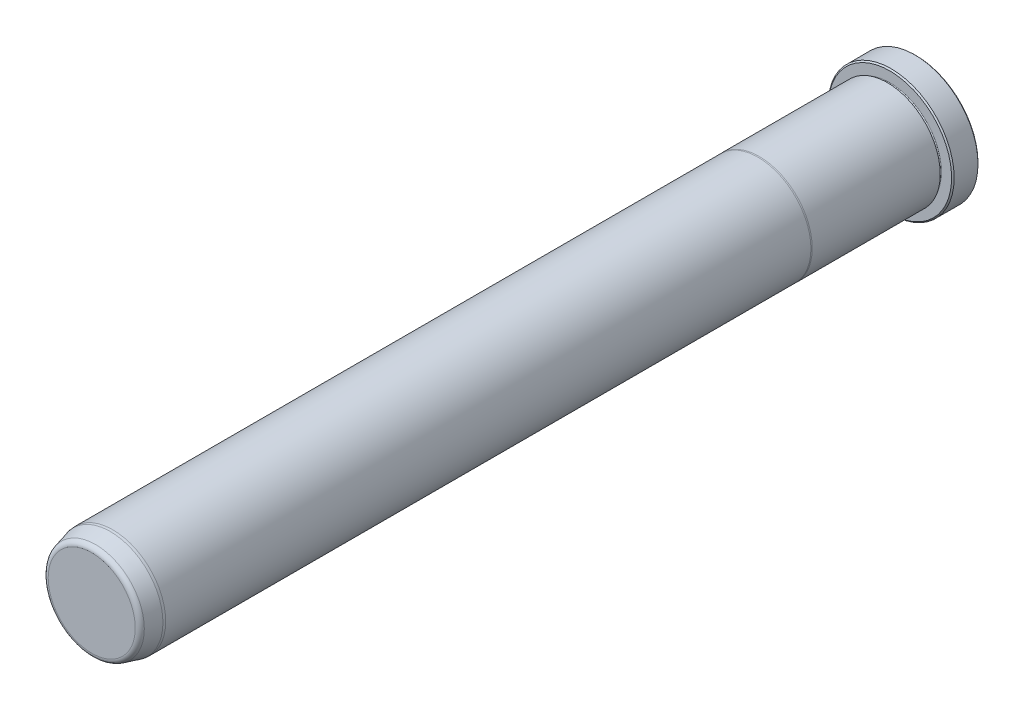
ISO-10303-21;
HEADER;
FILE_DESCRIPTION(('STEP AP214'),'2;1');
FILE_NAME('part.step','',(''),(''),'','','');
FILE_SCHEMA(('AUTOMOTIVE_DESIGN { 1 0 10303 214 1 1 1 1 }'));
ENDSEC;
DATA;
#1=APPLICATION_CONTEXT('core data for automotive mechanical design processes');
#2=APPLICATION_PROTOCOL_DEFINITION('international standard','automotive_design',2000,#1);
#3=PRODUCT_CONTEXT('',#1,'mechanical');
#4=PRODUCT('Part','Part','',(#3));
#5=PRODUCT_RELATED_PRODUCT_CATEGORY('part','',(#4));
#6=PRODUCT_DEFINITION_FORMATION('','',#4);
#7=PRODUCT_DEFINITION_CONTEXT('part definition',#1,'design');
#8=PRODUCT_DEFINITION('design','',#6,#7);
#9=PRODUCT_DEFINITION_SHAPE('','',#8);
#10=(LENGTH_UNIT() NAMED_UNIT(*) SI_UNIT(.MILLI.,.METRE.));
#11=(NAMED_UNIT(*) PLANE_ANGLE_UNIT() SI_UNIT($,.RADIAN.));
#12=(NAMED_UNIT(*) SI_UNIT($,.STERADIAN.) SOLID_ANGLE_UNIT());
#13=UNCERTAINTY_MEASURE_WITH_UNIT(LENGTH_MEASURE(1.E-05),#10,'distance_accuracy_value','');
#14=(GEOMETRIC_REPRESENTATION_CONTEXT(3) GLOBAL_UNCERTAINTY_ASSIGNED_CONTEXT((#13)) GLOBAL_UNIT_ASSIGNED_CONTEXT((#10,
#11,#12)) REPRESENTATION_CONTEXT('',''));
#15=CARTESIAN_POINT('',(0.,0.,0.));
#16=DIRECTION('',(0.,0.,1.));
#17=DIRECTION('',(1.,0.,0.));
#18=AXIS2_PLACEMENT_3D('',#15,#16,#17);
#19=CARTESIAN_POINT('',(0.,0.,0.));
#20=DIRECTION('',(0.,0.,1.));
#21=DIRECTION('',(1.,0.,0.));
#22=AXIS2_PLACEMENT_3D('',#19,#20,#21);
#23=PLANE('',#22);
#24=CARTESIAN_POINT('',(0.,0.,0.));
#25=DIRECTION('',(0.,0.,1.));
#26=DIRECTION('',(1.,0.,0.));
#27=AXIS2_PLACEMENT_3D('',#24,#25,#26);
#28=CIRCLE('',#27,18.542);
#29=CARTESIAN_POINT('',(18.542,0.,0.));
#30=VERTEX_POINT('',#29);
#31=EDGE_CURVE('E37',#30,#30,#28,.F.);
#32=ORIENTED_EDGE('',*,*,#31,.T.);
#33=EDGE_LOOP('',(#32));
#34=FACE_BOUND('',#33,.T.);
#35=ADVANCED_FACE('F30',(#34),#23,.F.);
#36=CARTESIAN_POINT('',(0.,0.,0.));
#37=DIRECTION('',(0.,0.,1.));
#38=DIRECTION('',(1.,0.,0.));
#39=AXIS2_PLACEMENT_3D('',#36,#37,#38);
#40=CYLINDRICAL_SURFACE('',#39,18.923);
#41=CARTESIAN_POINT('',(0.,0.,0.380999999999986));
#42=DIRECTION('',(0.,0.,1.));
#43=DIRECTION('',(1.,0.,0.));
#44=AXIS2_PLACEMENT_3D('',#41,#42,#43);
#45=CIRCLE('',#44,18.923);
#46=CARTESIAN_POINT('',(18.923,0.,0.380999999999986));
#47=VERTEX_POINT('',#46);
#48=EDGE_CURVE('E41',#47,#47,#45,.T.);
#49=ORIENTED_EDGE('',*,*,#48,.T.);
#50=EDGE_LOOP('',(#49));
#51=FACE_BOUND('',#50,.T.);
#52=CARTESIAN_POINT('',(0.,0.,7.54379999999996));
#53=DIRECTION('',(0.,0.,-1.));
#54=DIRECTION('',(-1.,0.,0.));
#55=AXIS2_PLACEMENT_3D('',#52,#53,#54);
#56=CIRCLE('',#55,18.923);
#57=CARTESIAN_POINT('',(-18.923,0.,7.54379999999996));
#58=VERTEX_POINT('',#57);
#59=EDGE_CURVE('E45',#58,#58,#56,.T.);
#60=ORIENTED_EDGE('',*,*,#59,.T.);
#61=EDGE_LOOP('',(#60));
#62=FACE_BOUND('',#61,.T.);
#63=ADVANCED_FACE('F118',(#51,#62),#40,.T.);
#64=CARTESIAN_POINT('',(0.,18.923,7.9248));
#65=DIRECTION('',(0.,0.,-1.));
#66=DIRECTION('',(-1.,0.,0.));
#67=AXIS2_PLACEMENT_3D('',#64,#65,#66);
#68=PLANE('',#67);
#69=CARTESIAN_POINT('',(0.,0.,7.9248));
#70=DIRECTION('',(0.,0.,-1.));
#71=DIRECTION('',(-1.,0.,0.));
#72=AXIS2_PLACEMENT_3D('',#69,#70,#71);
#73=CIRCLE('',#72,18.542);
#74=CARTESIAN_POINT('',(-18.542,0.,7.9248));
#75=VERTEX_POINT('',#74);
#76=EDGE_CURVE('E10',#75,#75,#73,.F.);
#77=ORIENTED_EDGE('',*,*,#76,.T.);
#78=EDGE_LOOP('',(#77));
#79=FACE_BOUND('',#78,.T.);
#80=CARTESIAN_POINT('',(0.,0.,7.9248));
#81=DIRECTION('',(0.,0.,1.));
#82=DIRECTION('',(1.,0.,0.));
#83=AXIS2_PLACEMENT_3D('',#80,#81,#82);
#84=CIRCLE('',#83,15.4813);
#85=CARTESIAN_POINT('',(15.4813,0.,7.9248));
#86=VERTEX_POINT('',#85);
#87=EDGE_CURVE('E56',#86,#86,#84,.T.);
#88=ORIENTED_EDGE('',*,*,#87,.F.);
#89=EDGE_LOOP('',(#88));
#90=FACE_BOUND('',#89,.T.);
#91=ADVANCED_FACE('F113',(#79,#90),#68,.F.);
#92=CARTESIAN_POINT('',(0.,0.,8.3058));
#93=DIRECTION('',(0.,0.,1.));
#94=DIRECTION('',(1.,0.,0.));
#95=AXIS2_PLACEMENT_3D('',#92,#93,#94);
#96=TOROIDAL_SURFACE('',#95,15.4813,0.381000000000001);
#97=CARTESIAN_POINT('',(0.,0.,8.6868));
#98=DIRECTION('',(0.,0.,1.));
#99=DIRECTION('',(1.,0.,0.));
#100=AXIS2_PLACEMENT_3D('',#97,#98,#99);
#101=CIRCLE('',#100,15.4813);
#102=CARTESIAN_POINT('',(15.4813,0.,8.6868));
#103=VERTEX_POINT('',#102);
#104=EDGE_CURVE('E59',#103,#103,#101,.T.);
#105=ORIENTED_EDGE('',*,*,#104,.F.);
#106=EDGE_LOOP('',(#105));
#107=FACE_BOUND('',#106,.T.);
#108=ORIENTED_EDGE('',*,*,#87,.T.);
#109=EDGE_LOOP('',(#108));
#110=FACE_BOUND('',#109,.T.);
#111=ADVANCED_FACE('F107',(#107,#110),#96,.F.);
#112=CARTESIAN_POINT('',(0.,15.4813,8.6868));
#113=DIRECTION('',(0.,0.,1.));
#114=DIRECTION('',(1.,0.,0.));
#115=AXIS2_PLACEMENT_3D('',#112,#113,#114);
#116=PLANE('',#115);
#117=CARTESIAN_POINT('',(0.,0.,8.6868));
#118=DIRECTION('',(0.,0.,1.));
#119=DIRECTION('',(1.,0.,0.));
#120=AXIS2_PLACEMENT_3D('',#117,#118,#119);
#121=CIRCLE('',#120,15.8877);
#122=CARTESIAN_POINT('',(15.8877,0.,8.6868));
#123=VERTEX_POINT('',#122);
#124=EDGE_CURVE('E62',#123,#123,#121,.T.);
#125=ORIENTED_EDGE('',*,*,#124,.F.);
#126=EDGE_LOOP('',(#125));
#127=FACE_BOUND('',#126,.T.);
#128=ORIENTED_EDGE('',*,*,#104,.T.);
#129=EDGE_LOOP('',(#128));
#130=FACE_BOUND('',#129,.T.);
#131=ADVANCED_FACE('F101',(#127,#130),#116,.F.);
#132=CARTESIAN_POINT('',(0.,0.,0.));
#133=DIRECTION('',(0.,0.,1.));
#134=DIRECTION('',(1.,0.,0.));
#135=AXIS2_PLACEMENT_3D('',#132,#133,#134);
#136=CYLINDRICAL_SURFACE('',#135,15.8877);
#137=CARTESIAN_POINT('',(0.,0.,47.1347630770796));
#138=DIRECTION('',(0.,0.,1.));
#139=DIRECTION('',(1.,0.,0.));
#140=AXIS2_PLACEMENT_3D('',#137,#138,#139);
#141=CIRCLE('',#140,15.8877);
#142=CARTESIAN_POINT('',(15.8877,0.,47.1347630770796));
#143=VERTEX_POINT('',#142);
#144=EDGE_CURVE('E65',#143,#143,#141,.T.);
#145=ORIENTED_EDGE('',*,*,#144,.F.);
#146=EDGE_LOOP('',(#145));
#147=FACE_BOUND('',#146,.T.);
#148=ORIENTED_EDGE('',*,*,#124,.T.);
#149=EDGE_LOOP('',(#148));
#150=FACE_BOUND('',#149,.T.);
#151=ADVANCED_FACE('F95',(#147,#150),#136,.T.);
#152=CARTESIAN_POINT('',(0.,0.,47.1347630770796));
#153=DIRECTION('',(0.,0.,-1.));
#154=DIRECTION('',(-1.,0.,0.));
#155=AXIS2_PLACEMENT_3D('',#152,#153,#154);
#156=CONICAL_SURFACE('',#155,15.8877,0.0698131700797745);
#157=CARTESIAN_POINT('',(0.,0.,47.498));
#158=DIRECTION('',(0.,0.,1.));
#159=DIRECTION('',(1.,0.,0.));
#160=AXIS2_PLACEMENT_3D('',#157,#158,#159);
#161=CIRCLE('',#160,15.8623);
#162=CARTESIAN_POINT('',(15.8623,0.,47.498));
#163=VERTEX_POINT('',#162);
#164=EDGE_CURVE('E68',#163,#163,#161,.T.);
#165=ORIENTED_EDGE('',*,*,#164,.F.);
#166=EDGE_LOOP('',(#165));
#167=FACE_BOUND('',#166,.T.);
#168=ORIENTED_EDGE('',*,*,#144,.T.);
#169=EDGE_LOOP('',(#168));
#170=FACE_BOUND('',#169,.T.);
#171=ADVANCED_FACE('F89',(#167,#170),#156,.T.);
#172=CARTESIAN_POINT('',(0.,0.,0.));
#173=DIRECTION('',(0.,0.,1.));
#174=DIRECTION('',(1.,0.,0.));
#175=AXIS2_PLACEMENT_3D('',#172,#173,#174);
#176=CYLINDRICAL_SURFACE('',#175,15.8623);
#177=CARTESIAN_POINT('',(0.,0.,241.3));
#178=DIRECTION('',(0.,0.,1.));
#179=DIRECTION('',(1.,0.,0.));
#180=AXIS2_PLACEMENT_3D('',#177,#178,#179);
#181=CIRCLE('',#180,15.8623);
#182=CARTESIAN_POINT('',(15.8623,0.,241.3));
#183=VERTEX_POINT('',#182);
#184=EDGE_CURVE('E71',#183,#183,#181,.T.);
#185=ORIENTED_EDGE('',*,*,#184,.F.);
#186=EDGE_LOOP('',(#185));
#187=FACE_BOUND('',#186,.T.);
#188=ORIENTED_EDGE('',*,*,#164,.T.);
#189=EDGE_LOOP('',(#188));
#190=FACE_BOUND('',#189,.T.);
#191=ADVANCED_FACE('F83',(#187,#190),#176,.T.);
#192=CARTESIAN_POINT('',(0.,0.,241.3));
#193=DIRECTION('',(0.,0.,-1.));
#194=DIRECTION('',(-1.,0.,0.));
#195=AXIS2_PLACEMENT_3D('',#192,#193,#194);
#196=CONICAL_SURFACE('',#195,15.8623,0.0872664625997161);
#197=CARTESIAN_POINT('',(0.,0.,242.062));
#198=DIRECTION('',(0.,0.,1.));
#199=DIRECTION('',(1.,0.,0.));
#200=AXIS2_PLACEMENT_3D('',#197,#198,#199);
#201=CIRCLE('',#200,15.7956336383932);
#202=CARTESIAN_POINT('',(15.7956336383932,0.,242.062));
#203=VERTEX_POINT('',#202);
#204=EDGE_CURVE('E74',#203,#203,#201,.T.);
#205=ORIENTED_EDGE('',*,*,#204,.F.);
#206=EDGE_LOOP('',(#205));
#207=FACE_BOUND('',#206,.T.);
#208=ORIENTED_EDGE('',*,*,#184,.T.);
#209=EDGE_LOOP('',(#208));
#210=FACE_BOUND('',#209,.T.);
#211=ADVANCED_FACE('F80',(#207,#210),#196,.T.);
#212=CARTESIAN_POINT('',(0.,0.,242.062));
#213=DIRECTION('',(0.,0.,-1.));
#214=DIRECTION('',(-1.,0.,0.));
#215=AXIS2_PLACEMENT_3D('',#212,#213,#214);
#216=CONICAL_SURFACE('',#215,15.7956336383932,0.26179938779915);
#217=CARTESIAN_POINT('',(0.,0.,246.4733752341));
#218=DIRECTION('',(0.,0.,1.));
#219=DIRECTION('',(1.,0.,0.));
#220=AXIS2_PLACEMENT_3D('',#217,#218,#219);
#221=CIRCLE('',#220,14.6136092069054);
#222=CARTESIAN_POINT('',(14.6136092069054,0.,246.4733752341));
#223=VERTEX_POINT('',#222);
#224=EDGE_CURVE('E50',#223,#223,#221,.F.);
#225=ORIENTED_EDGE('',*,*,#224,.T.);
#226=EDGE_LOOP('',(#225));
#227=FACE_BOUND('',#226,.T.);
#228=ORIENTED_EDGE('',*,*,#204,.T.);
#229=EDGE_LOOP('',(#228));
#230=FACE_BOUND('',#229,.T.);
#231=ADVANCED_FACE('F78',(#227,#230),#216,.T.);
#232=CARTESIAN_POINT('',(0.,14.2983335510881,247.65));
#233=DIRECTION('',(0.,0.,-1.));
#234=DIRECTION('',(-1.,0.,0.));
#235=AXIS2_PLACEMENT_3D('',#232,#233,#234);
#236=PLANE('',#235);
#237=CARTESIAN_POINT('',(0.,0.,247.65));
#238=DIRECTION('',(0.,0.,-1.));
#239=DIRECTION('',(-1.,0.,0.));
#240=AXIS2_PLACEMENT_3D('',#237,#238,#239);
#241=CIRCLE('',#240,13.0802019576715);
#242=CARTESIAN_POINT('',(-13.0802019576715,0.,247.65));
#243=VERTEX_POINT('',#242);
#244=EDGE_CURVE('E53',#243,#243,#241,.F.);
#245=ORIENTED_EDGE('',*,*,#244,.T.);
#246=EDGE_LOOP('',(#245));
#247=FACE_BOUND('',#246,.T.);
#248=ADVANCED_FACE('F133',(#247),#236,.F.);
#249=CARTESIAN_POINT('',(0.,0.,246.0625));
#250=DIRECTION('',(0.,0.,-1.));
#251=DIRECTION('',(-1.,0.,0.));
#252=AXIS2_PLACEMENT_3D('',#249,#250,#251);
#253=TOROIDAL_SURFACE('',#252,13.0802019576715,1.5875);
#254=ORIENTED_EDGE('',*,*,#224,.F.);
#255=EDGE_LOOP('',(#254));
#256=FACE_BOUND('',#255,.T.);
#257=ORIENTED_EDGE('',*,*,#244,.F.);
#258=EDGE_LOOP('',(#257));
#259=FACE_BOUND('',#258,.T.);
#260=ADVANCED_FACE('F130',(#256,#259),#253,.T.);
#261=CARTESIAN_POINT('',(0.,0.,0.380999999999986));
#262=DIRECTION('',(0.,0.,1.));
#263=DIRECTION('',(1.,0.,0.));
#264=AXIS2_PLACEMENT_3D('',#261,#262,#263);
#265=CONICAL_SURFACE('',#264,18.923,0.785398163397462);
#266=ORIENTED_EDGE('',*,*,#31,.F.);
#267=EDGE_LOOP('',(#266));
#268=FACE_BOUND('',#267,.T.);
#269=ORIENTED_EDGE('',*,*,#48,.F.);
#270=EDGE_LOOP('',(#269));
#271=FACE_BOUND('',#270,.T.);
#272=ADVANCED_FACE('F132',(#268,#271),#265,.T.);
#273=CARTESIAN_POINT('',(0.,0.,7.9248));
#274=DIRECTION('',(0.,0.,-1.));
#275=DIRECTION('',(-1.,0.,0.));
#276=AXIS2_PLACEMENT_3D('',#273,#274,#275);
#277=CONICAL_SURFACE('',#276,18.542,0.785398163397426);
#278=ORIENTED_EDGE('',*,*,#59,.F.);
#279=EDGE_LOOP('',(#278));
#280=FACE_BOUND('',#279,.T.);
#281=ORIENTED_EDGE('',*,*,#76,.F.);
#282=EDGE_LOOP('',(#281));
#283=FACE_BOUND('',#282,.T.);
#284=ADVANCED_FACE('F32',(#280,#283),#277,.T.);
#285=CLOSED_SHELL('',(#35,#63,#91,#111,#131,#151,#171,#191,#211,#231,#248,#260,#272,#284));
#286=MANIFOLD_SOLID_BREP('B2',#285);
#287=ADVANCED_BREP_SHAPE_REPRESENTATION('',(#18,#286),#14);
#288=SHAPE_DEFINITION_REPRESENTATION(#9,#287);
ENDSEC;
END-ISO-10303-21;
